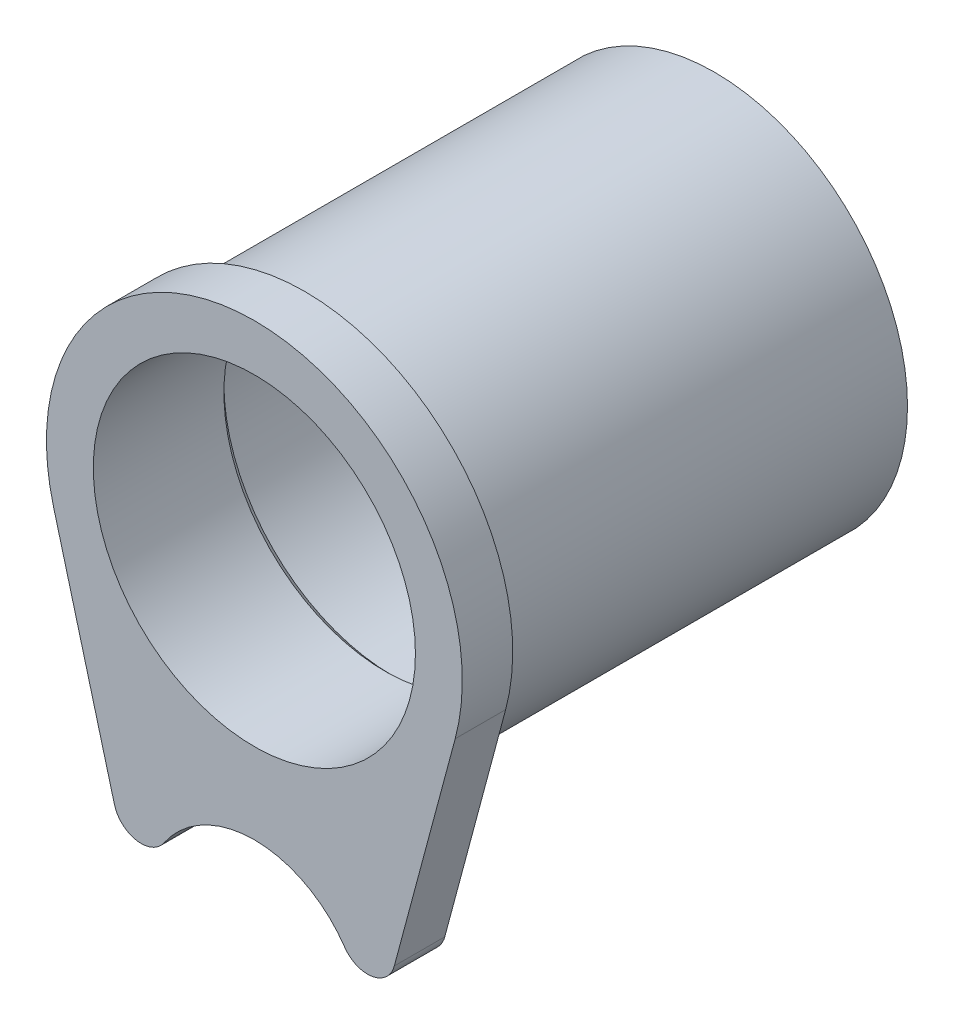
ISO-10303-21;
HEADER;
FILE_DESCRIPTION(('STEP AP214'),'2;1');
FILE_NAME('part.step','',(''),(''),'','','');
FILE_SCHEMA(('AUTOMOTIVE_DESIGN { 1 0 10303 214 1 1 1 1 }'));
ENDSEC;
DATA;
#1=APPLICATION_CONTEXT('core data for automotive mechanical design processes');
#2=APPLICATION_PROTOCOL_DEFINITION('international standard','automotive_design',2000,#1);
#3=PRODUCT_CONTEXT('',#1,'mechanical');
#4=PRODUCT('Part','Part','',(#3));
#5=PRODUCT_RELATED_PRODUCT_CATEGORY('part','',(#4));
#6=PRODUCT_DEFINITION_FORMATION('','',#4);
#7=PRODUCT_DEFINITION_CONTEXT('part definition',#1,'design');
#8=PRODUCT_DEFINITION('design','',#6,#7);
#9=PRODUCT_DEFINITION_SHAPE('','',#8);
#10=(LENGTH_UNIT() NAMED_UNIT(*) SI_UNIT(.MILLI.,.METRE.));
#11=(NAMED_UNIT(*) PLANE_ANGLE_UNIT() SI_UNIT($,.RADIAN.));
#12=(NAMED_UNIT(*) SI_UNIT($,.STERADIAN.) SOLID_ANGLE_UNIT());
#13=UNCERTAINTY_MEASURE_WITH_UNIT(LENGTH_MEASURE(1.E-05),#10,'distance_accuracy_value','');
#14=(GEOMETRIC_REPRESENTATION_CONTEXT(3) GLOBAL_UNCERTAINTY_ASSIGNED_CONTEXT((#13)) GLOBAL_UNIT_ASSIGNED_CONTEXT((#10,
#11,#12)) REPRESENTATION_CONTEXT('',''));
#15=CARTESIAN_POINT('',(0.,0.,0.));
#16=DIRECTION('',(0.,0.,1.));
#17=DIRECTION('',(1.,0.,0.));
#18=AXIS2_PLACEMENT_3D('',#15,#16,#17);
#19=CARTESIAN_POINT('',(0.,0.,-21.082));
#20=DIRECTION('',(0.,0.,1.));
#21=DIRECTION('',(1.,0.,0.));
#22=AXIS2_PLACEMENT_3D('',#19,#20,#21);
#23=CYLINDRICAL_SURFACE('',#22,8.8392);
#24=CARTESIAN_POINT('',(0.,0.,-8.0772));
#25=DIRECTION('',(0.,0.,1.));
#26=DIRECTION('',(-1.,0.,0.));
#27=AXIS2_PLACEMENT_3D('',#24,#25,#26);
#28=CIRCLE('',#27,8.8392);
#29=CARTESIAN_POINT('',(-8.57663798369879,-2.13839601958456,-8.0772));
#30=VERTEX_POINT('',#29);
#31=CARTESIAN_POINT('',(-1.53491097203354,-8.70491269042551,-8.0772));
#32=VERTEX_POINT('',#31);
#33=EDGE_CURVE('E250',#30,#32,#28,.T.);
#34=ORIENTED_EDGE('',*,*,#33,.F.);
#35=DIRECTION('',(0.,0.,1.));
#36=VECTOR('',#35,1.);
#37=CARTESIAN_POINT('',(-8.57663798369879,-2.13839601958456,-8.0772));
#38=LINE('',#37,#36);
#39=CARTESIAN_POINT('',(-8.57663798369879,-2.13839601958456,-5.2324));
#40=VERTEX_POINT('',#39);
#41=EDGE_CURVE('E289',#30,#40,#38,.T.);
#42=ORIENTED_EDGE('',*,*,#41,.T.);
#43=CARTESIAN_POINT('',(0.,0.,-5.2324));
#44=DIRECTION('',(0.,0.,1.));
#45=DIRECTION('',(-1.,0.,0.));
#46=AXIS2_PLACEMENT_3D('',#43,#44,#45);
#47=CIRCLE('',#46,8.8392);
#48=CARTESIAN_POINT('',(-1.53491097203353,-8.70491269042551,-5.2324));
#49=VERTEX_POINT('',#48);
#50=EDGE_CURVE('E265',#40,#49,#47,.T.);
#51=ORIENTED_EDGE('',*,*,#50,.T.);
#52=DIRECTION('',(0.,0.,1.));
#53=VECTOR('',#52,1.);
#54=CARTESIAN_POINT('',(-1.53491097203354,-8.70491269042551,-8.0772));
#55=LINE('',#54,#53);
#56=EDGE_CURVE('E49',#32,#49,#55,.T.);
#57=ORIENTED_EDGE('',*,*,#56,.F.);
#58=EDGE_LOOP('',(#34,#42,#51,#57));
#59=FACE_BOUND('',#58,.T.);
#60=CARTESIAN_POINT('',(0.,0.,-2.6924));
#61=DIRECTION('',(0.,0.,1.));
#62=DIRECTION('',(1.,0.,0.));
#63=AXIS2_PLACEMENT_3D('',#60,#61,#62);
#64=CIRCLE('',#63,8.8392);
#65=CARTESIAN_POINT('',(8.8392,0.,-2.6924));
#66=VERTEX_POINT('',#65);
#67=EDGE_CURVE('E42',#66,#66,#64,.F.);
#68=ORIENTED_EDGE('',*,*,#67,.T.);
#69=EDGE_LOOP('',(#68));
#70=FACE_BOUND('',#69,.T.);
#71=CARTESIAN_POINT('',(0.,0.,-21.082));
#72=DIRECTION('',(0.,0.,1.));
#73=DIRECTION('',(1.,0.,0.));
#74=AXIS2_PLACEMENT_3D('',#71,#72,#73);
#75=CIRCLE('',#74,8.8392);
#76=CARTESIAN_POINT('',(8.8392,0.,-21.082));
#77=VERTEX_POINT('',#76);
#78=EDGE_CURVE('E164',#77,#77,#75,.T.);
#79=ORIENTED_EDGE('',*,*,#78,.T.);
#80=EDGE_LOOP('',(#79));
#81=FACE_BOUND('',#80,.T.);
#82=ADVANCED_FACE('F34',(#59,#70,#81),#23,.T.);
#83=CARTESIAN_POINT('',(0.,0.,-21.082));
#84=DIRECTION('',(0.,0.,1.));
#85=DIRECTION('',(1.,0.,0.));
#86=AXIS2_PLACEMENT_3D('',#83,#84,#85);
#87=PLANE('',#86);
#88=CARTESIAN_POINT('',(0.,0.,-21.082));
#89=DIRECTION('',(0.,0.,-1.));
#90=DIRECTION('',(-1.,0.,0.));
#91=AXIS2_PLACEMENT_3D('',#88,#89,#90);
#92=CIRCLE('',#91,7.747);
#93=CARTESIAN_POINT('',(-7.747,0.,-21.082));
#94=VERTEX_POINT('',#93);
#95=EDGE_CURVE('E161',#94,#94,#92,.T.);
#96=ORIENTED_EDGE('',*,*,#95,.F.);
#97=EDGE_LOOP('',(#96));
#98=FACE_BOUND('',#97,.T.);
#99=ORIENTED_EDGE('',*,*,#78,.F.);
#100=EDGE_LOOP('',(#99));
#101=FACE_BOUND('',#100,.T.);
#102=ADVANCED_FACE('F185',(#98,#101),#87,.F.);
#103=CARTESIAN_POINT('',(0.,0.,0.));
#104=DIRECTION('',(0.,0.,1.));
#105=DIRECTION('',(1.,0.,0.));
#106=AXIS2_PLACEMENT_3D('',#103,#104,#105);
#107=PLANE('',#106);
#108=CARTESIAN_POINT('',(0.,0.,0.));
#109=DIRECTION('',(0.,0.,1.));
#110=DIRECTION('',(1.,0.,0.));
#111=AXIS2_PLACEMENT_3D('',#108,#109,#110);
#112=CIRCLE('',#111,7.3787);
#113=CARTESIAN_POINT('',(7.3787,0.,0.));
#114=VERTEX_POINT('',#113);
#115=EDGE_CURVE('E153',#114,#114,#112,.T.);
#116=ORIENTED_EDGE('',*,*,#115,.F.);
#117=EDGE_LOOP('',(#116));
#118=FACE_BOUND('',#117,.T.);
#119=CARTESIAN_POINT('',(-5.18464880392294,-12.5454980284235,0.));
#120=DIRECTION('',(0.,0.,1.));
#121=DIRECTION('',(1.,0.,0.));
#122=AXIS2_PLACEMENT_3D('',#119,#120,#121);
#123=CIRCLE('',#122,1.27);
#124=CARTESIAN_POINT('',(-6.41137460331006,-12.8741982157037,0.));
#125=VERTEX_POINT('',#124);
#126=CARTESIAN_POINT('',(-4.13512475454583,-13.2606198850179,0.));
#127=VERTEX_POINT('',#126);
#128=EDGE_CURVE('E135',#125,#127,#123,.T.);
#129=ORIENTED_EDGE('',*,*,#128,.T.);
#130=CARTESIAN_POINT('',(0.,-16.0782,0.));
#131=DIRECTION('',(0.,0.,-1.));
#132=DIRECTION('',(1.,0.,0.));
#133=AXIS2_PLACEMENT_3D('',#130,#131,#132);
#134=CIRCLE('',#133,5.0038);
#135=CARTESIAN_POINT('',(4.13512475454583,-13.2606198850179,0.));
#136=VERTEX_POINT('',#135);
#137=EDGE_CURVE('E138',#127,#136,#134,.T.);
#138=ORIENTED_EDGE('',*,*,#137,.T.);
#139=CARTESIAN_POINT('',(5.18464880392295,-12.5454980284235,0.));
#140=DIRECTION('',(0.,0.,1.));
#141=DIRECTION('',(1.,0.,0.));
#142=AXIS2_PLACEMENT_3D('',#139,#140,#141);
#143=CIRCLE('',#142,1.27);
#144=CARTESIAN_POINT('',(6.41137460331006,-12.8741982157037,0.));
#145=VERTEX_POINT('',#144);
#146=EDGE_CURVE('E142',#136,#145,#143,.T.);
#147=ORIENTED_EDGE('',*,*,#146,.T.);
#148=DIRECTION('',(0.258819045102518,0.965925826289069,0.));
#149=VECTOR('',#148,1.);
#150=CARTESIAN_POINT('',(6.41137460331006,-12.8741982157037,0.));
#151=LINE('',#150,#149);
#152=CARTESIAN_POINT('',(9.20044349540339,-2.46525140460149,0.));
#153=VERTEX_POINT('',#152);
#154=EDGE_CURVE('E145',#145,#153,#151,.T.);
#155=ORIENTED_EDGE('',*,*,#154,.T.);
#156=CARTESIAN_POINT('',(0.,0.,0.));
#157=DIRECTION('',(0.,0.,1.));
#158=DIRECTION('',(1.,0.,0.));
#159=AXIS2_PLACEMENT_3D('',#156,#157,#158);
#160=CIRCLE('',#159,9.52500000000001);
#161=CARTESIAN_POINT('',(-9.20044349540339,-2.46525140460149,0.));
#162=VERTEX_POINT('',#161);
#163=EDGE_CURVE('E111',#153,#162,#160,.T.);
#164=ORIENTED_EDGE('',*,*,#163,.T.);
#165=DIRECTION('',(0.258819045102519,-0.965925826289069,0.));
#166=VECTOR('',#165,1.);
#167=CARTESIAN_POINT('',(-9.20044349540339,-2.46525140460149,0.));
#168=LINE('',#167,#166);
#169=EDGE_CURVE('E148',#162,#125,#168,.T.);
#170=ORIENTED_EDGE('',*,*,#169,.T.);
#171=EDGE_LOOP('',(#129,#138,#147,#155,#164,#170));
#172=FACE_BOUND('',#171,.T.);
#173=ADVANCED_FACE('F190',(#118,#172),#107,.T.);
#174=CARTESIAN_POINT('',(0.,0.,-6.35));
#175=DIRECTION('',(0.,0.,-1.));
#176=DIRECTION('',(-1.,0.,0.));
#177=AXIS2_PLACEMENT_3D('',#174,#175,#176);
#178=CYLINDRICAL_SURFACE('',#177,7.747);
#179=CARTESIAN_POINT('',(0.,0.,-6.35));
#180=DIRECTION('',(0.,0.,1.));
#181=DIRECTION('',(1.,0.,0.));
#182=AXIS2_PLACEMENT_3D('',#179,#180,#181);
#183=CIRCLE('',#182,7.747);
#184=CARTESIAN_POINT('',(7.747,0.,-6.35));
#185=VERTEX_POINT('',#184);
#186=EDGE_CURVE('E266',#185,#185,#183,.T.);
#187=ORIENTED_EDGE('',*,*,#186,.T.);
#188=EDGE_LOOP('',(#187));
#189=FACE_BOUND('',#188,.T.);
#190=ORIENTED_EDGE('',*,*,#95,.T.);
#191=EDGE_LOOP('',(#190));
#192=FACE_BOUND('',#191,.T.);
#193=ADVANCED_FACE('F196',(#189,#192),#178,.F.);
#194=CARTESIAN_POINT('',(0.,0.,8.382));
#195=DIRECTION('',(0.,0.,-1.));
#196=DIRECTION('',(-1.,0.,0.));
#197=AXIS2_PLACEMENT_3D('',#194,#195,#196);
#198=CYLINDRICAL_SURFACE('',#197,7.3787);
#199=CARTESIAN_POINT('',(0.,0.,-5.9817));
#200=DIRECTION('',(0.,0.,1.));
#201=DIRECTION('',(1.,0.,0.));
#202=AXIS2_PLACEMENT_3D('',#199,#200,#201);
#203=CIRCLE('',#202,7.3787);
#204=CARTESIAN_POINT('',(7.3787,0.,-5.9817));
#205=VERTEX_POINT('',#204);
#206=EDGE_CURVE('E139',#205,#205,#203,.T.);
#207=ORIENTED_EDGE('',*,*,#206,.F.);
#208=EDGE_LOOP('',(#207));
#209=FACE_BOUND('',#208,.T.);
#210=ORIENTED_EDGE('',*,*,#115,.T.);
#211=EDGE_LOOP('',(#210));
#212=FACE_BOUND('',#211,.T.);
#213=ADVANCED_FACE('F201',(#209,#212),#198,.F.);
#214=CARTESIAN_POINT('',(-5.18464880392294,-12.5454980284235,-2.3114));
#215=DIRECTION('',(0.,0.,1.));
#216=DIRECTION('',(1.,0.,0.));
#217=AXIS2_PLACEMENT_3D('',#214,#215,#216);
#218=CYLINDRICAL_SURFACE('',#217,1.27);
#219=ORIENTED_EDGE('',*,*,#128,.F.);
#220=DIRECTION('',(0.,0.,1.));
#221=VECTOR('',#220,1.);
#222=CARTESIAN_POINT('',(-6.41137460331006,-12.8741982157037,-2.3114));
#223=LINE('',#222,#221);
#224=CARTESIAN_POINT('',(-6.41137460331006,-12.8741982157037,-2.3114));
#225=VERTEX_POINT('',#224);
#226=EDGE_CURVE('E58',#225,#125,#223,.T.);
#227=ORIENTED_EDGE('',*,*,#226,.F.);
#228=CARTESIAN_POINT('',(-5.18464880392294,-12.5454980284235,-2.3114));
#229=DIRECTION('',(0.,0.,1.));
#230=DIRECTION('',(1.,0.,0.));
#231=AXIS2_PLACEMENT_3D('',#228,#229,#230);
#232=CIRCLE('',#231,1.27);
#233=CARTESIAN_POINT('',(-4.13512475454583,-13.2606198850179,-2.3114));
#234=VERTEX_POINT('',#233);
#235=EDGE_CURVE('E151',#225,#234,#232,.T.);
#236=ORIENTED_EDGE('',*,*,#235,.T.);
#237=DIRECTION('',(0.,0.,1.));
#238=VECTOR('',#237,1.);
#239=CARTESIAN_POINT('',(-4.13512475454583,-13.2606198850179,-2.3114));
#240=LINE('',#239,#238);
#241=EDGE_CURVE('E91',#234,#127,#240,.T.);
#242=ORIENTED_EDGE('',*,*,#241,.T.);
#243=EDGE_LOOP('',(#219,#227,#236,#242));
#244=FACE_BOUND('',#243,.T.);
#245=ADVANCED_FACE('F205',(#244),#218,.T.);
#246=CARTESIAN_POINT('',(-9.20044349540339,-2.46525140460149,-2.3114));
#247=DIRECTION('',(-0.965925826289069,-0.258819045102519,0.));
#248=DIRECTION('',(0.258819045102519,-0.965925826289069,0.));
#249=AXIS2_PLACEMENT_3D('',#246,#247,#248);
#250=PLANE('',#249);
#251=ORIENTED_EDGE('',*,*,#169,.F.);
#252=DIRECTION('',(0.,0.,1.));
#253=VECTOR('',#252,1.);
#254=CARTESIAN_POINT('',(-9.20044349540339,-2.46525140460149,-2.3114));
#255=LINE('',#254,#253);
#256=CARTESIAN_POINT('',(-9.20044349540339,-2.46525140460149,-2.3114));
#257=VERTEX_POINT('',#256);
#258=EDGE_CURVE('E116',#257,#162,#255,.T.);
#259=ORIENTED_EDGE('',*,*,#258,.F.);
#260=DIRECTION('',(0.258819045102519,-0.965925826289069,0.));
#261=VECTOR('',#260,1.);
#262=CARTESIAN_POINT('',(-9.20044349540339,-2.46525140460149,-2.3114));
#263=LINE('',#262,#261);
#264=EDGE_CURVE('E125',#257,#225,#263,.T.);
#265=ORIENTED_EDGE('',*,*,#264,.T.);
#266=ORIENTED_EDGE('',*,*,#226,.T.);
#267=EDGE_LOOP('',(#251,#259,#265,#266));
#268=FACE_BOUND('',#267,.T.);
#269=ADVANCED_FACE('F209',(#268),#250,.T.);
#270=CARTESIAN_POINT('',(0.,0.,-2.3114));
#271=DIRECTION('',(0.,0.,1.));
#272=DIRECTION('',(1.,0.,0.));
#273=AXIS2_PLACEMENT_3D('',#270,#271,#272);
#274=CYLINDRICAL_SURFACE('',#273,9.52500000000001);
#275=ORIENTED_EDGE('',*,*,#163,.F.);
#276=DIRECTION('',(0.,0.,1.));
#277=VECTOR('',#276,1.);
#278=CARTESIAN_POINT('',(9.20044349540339,-2.46525140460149,-2.3114));
#279=LINE('',#278,#277);
#280=CARTESIAN_POINT('',(9.20044349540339,-2.46525140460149,-2.3114));
#281=VERTEX_POINT('',#280);
#282=EDGE_CURVE('E105',#281,#153,#279,.T.);
#283=ORIENTED_EDGE('',*,*,#282,.F.);
#284=CARTESIAN_POINT('',(0.,0.,-2.3114));
#285=DIRECTION('',(0.,0.,1.));
#286=DIRECTION('',(1.,0.,0.));
#287=AXIS2_PLACEMENT_3D('',#284,#285,#286);
#288=CIRCLE('',#287,9.52500000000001);
#289=EDGE_CURVE('E108',#281,#257,#288,.T.);
#290=ORIENTED_EDGE('',*,*,#289,.T.);
#291=ORIENTED_EDGE('',*,*,#258,.T.);
#292=EDGE_LOOP('',(#275,#283,#290,#291));
#293=FACE_BOUND('',#292,.T.);
#294=ADVANCED_FACE('F107',(#293),#274,.T.);
#295=CARTESIAN_POINT('',(6.41137460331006,-12.8741982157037,-2.3114));
#296=DIRECTION('',(0.965925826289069,-0.258819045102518,0.));
#297=DIRECTION('',(0.258819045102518,0.965925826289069,0.));
#298=AXIS2_PLACEMENT_3D('',#295,#296,#297);
#299=PLANE('',#298);
#300=ORIENTED_EDGE('',*,*,#154,.F.);
#301=DIRECTION('',(0.,0.,1.));
#302=VECTOR('',#301,1.);
#303=CARTESIAN_POINT('',(6.41137460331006,-12.8741982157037,-2.3114));
#304=LINE('',#303,#302);
#305=CARTESIAN_POINT('',(6.41137460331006,-12.8741982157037,-2.3114));
#306=VERTEX_POINT('',#305);
#307=EDGE_CURVE('E117',#306,#145,#304,.T.);
#308=ORIENTED_EDGE('',*,*,#307,.F.);
#309=DIRECTION('',(0.258819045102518,0.965925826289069,0.));
#310=VECTOR('',#309,1.);
#311=CARTESIAN_POINT('',(6.41137460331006,-12.8741982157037,-2.3114));
#312=LINE('',#311,#310);
#313=EDGE_CURVE('E123',#306,#281,#312,.T.);
#314=ORIENTED_EDGE('',*,*,#313,.T.);
#315=ORIENTED_EDGE('',*,*,#282,.T.);
#316=EDGE_LOOP('',(#300,#308,#314,#315));
#317=FACE_BOUND('',#316,.T.);
#318=ADVANCED_FACE('F127',(#317),#299,.T.);
#319=CARTESIAN_POINT('',(5.18464880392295,-12.5454980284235,-2.3114));
#320=DIRECTION('',(0.,0.,1.));
#321=DIRECTION('',(1.,0.,0.));
#322=AXIS2_PLACEMENT_3D('',#319,#320,#321);
#323=CYLINDRICAL_SURFACE('',#322,1.27);
#324=ORIENTED_EDGE('',*,*,#146,.F.);
#325=DIRECTION('',(0.,0.,1.));
#326=VECTOR('',#325,1.);
#327=CARTESIAN_POINT('',(4.13512475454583,-13.2606198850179,-2.3114));
#328=LINE('',#327,#326);
#329=CARTESIAN_POINT('',(4.13512475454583,-13.2606198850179,-2.3114));
#330=VERTEX_POINT('',#329);
#331=EDGE_CURVE('E156',#330,#136,#328,.T.);
#332=ORIENTED_EDGE('',*,*,#331,.F.);
#333=CARTESIAN_POINT('',(5.18464880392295,-12.5454980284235,-2.3114));
#334=DIRECTION('',(0.,0.,1.));
#335=DIRECTION('',(1.,0.,0.));
#336=AXIS2_PLACEMENT_3D('',#333,#334,#335);
#337=CIRCLE('',#336,1.27);
#338=EDGE_CURVE('E128',#330,#306,#337,.T.);
#339=ORIENTED_EDGE('',*,*,#338,.T.);
#340=ORIENTED_EDGE('',*,*,#307,.T.);
#341=EDGE_LOOP('',(#324,#332,#339,#340));
#342=FACE_BOUND('',#341,.T.);
#343=ADVANCED_FACE('F213',(#342),#323,.T.);
#344=CARTESIAN_POINT('',(0.,-16.0782,-2.3114));
#345=DIRECTION('',(0.,0.,1.));
#346=DIRECTION('',(1.,0.,0.));
#347=AXIS2_PLACEMENT_3D('',#344,#345,#346);
#348=CYLINDRICAL_SURFACE('',#347,5.0038);
#349=ORIENTED_EDGE('',*,*,#137,.F.);
#350=ORIENTED_EDGE('',*,*,#241,.F.);
#351=CARTESIAN_POINT('',(0.,-16.0782,-2.3114));
#352=DIRECTION('',(0.,0.,-1.));
#353=DIRECTION('',(1.,0.,0.));
#354=AXIS2_PLACEMENT_3D('',#351,#352,#353);
#355=CIRCLE('',#354,5.0038);
#356=EDGE_CURVE('E130',#234,#330,#355,.T.);
#357=ORIENTED_EDGE('',*,*,#356,.T.);
#358=ORIENTED_EDGE('',*,*,#331,.T.);
#359=EDGE_LOOP('',(#349,#350,#357,#358));
#360=FACE_BOUND('',#359,.T.);
#361=ADVANCED_FACE('F210',(#360),#348,.F.);
#362=CARTESIAN_POINT('',(-5.18464880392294,-12.5454980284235,-2.3114));
#363=DIRECTION('',(0.,0.,1.));
#364=DIRECTION('',(1.,0.,0.));
#365=AXIS2_PLACEMENT_3D('',#362,#363,#364);
#366=PLANE('',#365);
#367=CARTESIAN_POINT('',(0.,0.,-2.3114));
#368=DIRECTION('',(0.,0.,1.));
#369=DIRECTION('',(1.,0.,0.));
#370=AXIS2_PLACEMENT_3D('',#367,#368,#369);
#371=CIRCLE('',#370,9.2202);
#372=CARTESIAN_POINT('',(9.2202,0.,-2.3114));
#373=VERTEX_POINT('',#372);
#374=EDGE_CURVE('E11',#373,#373,#371,.T.);
#375=ORIENTED_EDGE('',*,*,#374,.T.);
#376=EDGE_LOOP('',(#375));
#377=FACE_BOUND('',#376,.T.);
#378=ORIENTED_EDGE('',*,*,#235,.F.);
#379=ORIENTED_EDGE('',*,*,#264,.F.);
#380=ORIENTED_EDGE('',*,*,#289,.F.);
#381=ORIENTED_EDGE('',*,*,#313,.F.);
#382=ORIENTED_EDGE('',*,*,#338,.F.);
#383=ORIENTED_EDGE('',*,*,#356,.F.);
#384=EDGE_LOOP('',(#378,#379,#380,#381,#382,#383));
#385=FACE_BOUND('',#384,.T.);
#386=ADVANCED_FACE('F121',(#377,#385),#366,.F.);
#387=CARTESIAN_POINT('',(0.,0.,-5.9817));
#388=DIRECTION('',(0.,0.,-1.));
#389=DIRECTION('',(-1.,0.,0.));
#390=AXIS2_PLACEMENT_3D('',#387,#388,#389);
#391=CONICAL_SURFACE('',#390,7.3787,0.785398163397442);
#392=ORIENTED_EDGE('',*,*,#186,.F.);
#393=EDGE_LOOP('',(#392));
#394=FACE_BOUND('',#393,.T.);
#395=ORIENTED_EDGE('',*,*,#206,.T.);
#396=EDGE_LOOP('',(#395));
#397=FACE_BOUND('',#396,.T.);
#398=ADVANCED_FACE('F173',(#394,#397),#391,.F.);
#399=CARTESIAN_POINT('',(0.,0.,-2.6924));
#400=DIRECTION('',(0.,0.,1.));
#401=DIRECTION('',(1.,0.,0.));
#402=AXIS2_PLACEMENT_3D('',#399,#400,#401);
#403=TOROIDAL_SURFACE('',#402,9.2202,0.381);
#404=ORIENTED_EDGE('',*,*,#374,.F.);
#405=EDGE_LOOP('',(#404));
#406=FACE_BOUND('',#405,.T.);
#407=ORIENTED_EDGE('',*,*,#67,.F.);
#408=EDGE_LOOP('',(#407));
#409=FACE_BOUND('',#408,.T.);
#410=ADVANCED_FACE('F36',(#406,#409),#403,.F.);
#411=CARTESIAN_POINT('',(-2.54936362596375,-14.4581595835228,-8.0772));
#412=DIRECTION('',(0.,0.,1.));
#413=DIRECTION('',(1.,0.,0.));
#414=AXIS2_PLACEMENT_3D('',#411,#412,#413);
#415=CYLINDRICAL_SURFACE('',#414,5.842);
#416=CARTESIAN_POINT('',(-2.54936362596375,-14.4581595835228,-5.2324));
#417=DIRECTION('',(0.,0.,1.));
#418=DIRECTION('',(-1.,0.,0.));
#419=AXIS2_PLACEMENT_3D('',#416,#417,#418);
#420=CIRCLE('',#419,5.842);
#421=CARTESIAN_POINT('',(-4.55119357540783,-8.96984100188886,-5.2324));
#422=VERTEX_POINT('',#421);
#423=EDGE_CURVE('E299',#49,#422,#420,.T.);
#424=ORIENTED_EDGE('',*,*,#423,.T.);
#425=DIRECTION('',(0.,0.,1.));
#426=VECTOR('',#425,1.);
#427=CARTESIAN_POINT('',(-4.55119357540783,-8.96984100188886,-8.0772));
#428=LINE('',#427,#426);
#429=CARTESIAN_POINT('',(-4.55119357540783,-8.96984100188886,-8.0772));
#430=VERTEX_POINT('',#429);
#431=EDGE_CURVE('E267',#430,#422,#428,.T.);
#432=ORIENTED_EDGE('',*,*,#431,.F.);
#433=CARTESIAN_POINT('',(-2.54936362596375,-14.4581595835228,-8.0772));
#434=DIRECTION('',(0.,0.,1.));
#435=DIRECTION('',(-1.,0.,0.));
#436=AXIS2_PLACEMENT_3D('',#433,#434,#435);
#437=CIRCLE('',#436,5.842);
#438=EDGE_CURVE('E253',#32,#430,#437,.T.);
#439=ORIENTED_EDGE('',*,*,#438,.F.);
#440=ORIENTED_EDGE('',*,*,#56,.T.);
#441=EDGE_LOOP('',(#424,#432,#439,#440));
#442=FACE_BOUND('',#441,.T.);
#443=ADVANCED_FACE('F172',(#442),#415,.F.);
#444=CARTESIAN_POINT('',(0.,0.,-8.0772));
#445=DIRECTION('',(0.,0.,1.));
#446=DIRECTION('',(1.,0.,0.));
#447=AXIS2_PLACEMENT_3D('',#444,#445,#446);
#448=CYLINDRICAL_SURFACE('',#447,10.0584);
#449=CARTESIAN_POINT('',(0.,0.,-5.2324));
#450=DIRECTION('',(0.,0.,-1.));
#451=DIRECTION('',(-1.,0.,0.));
#452=AXIS2_PLACEMENT_3D('',#449,#450,#451);
#453=CIRCLE('',#452,10.0584);
#454=CARTESIAN_POINT('',(-8.36394188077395,-5.58711793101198,-5.2324));
#455=VERTEX_POINT('',#454);
#456=EDGE_CURVE('E296',#422,#455,#453,.T.);
#457=ORIENTED_EDGE('',*,*,#456,.T.);
#458=DIRECTION('',(0.,0.,1.));
#459=VECTOR('',#458,1.);
#460=CARTESIAN_POINT('',(-8.36394188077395,-5.58711793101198,-8.0772));
#461=LINE('',#460,#459);
#462=CARTESIAN_POINT('',(-8.36394188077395,-5.58711793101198,-8.0772));
#463=VERTEX_POINT('',#462);
#464=EDGE_CURVE('E272',#463,#455,#461,.T.);
#465=ORIENTED_EDGE('',*,*,#464,.F.);
#466=CARTESIAN_POINT('',(0.,0.,-8.0772));
#467=DIRECTION('',(0.,0.,-1.));
#468=DIRECTION('',(-1.,0.,0.));
#469=AXIS2_PLACEMENT_3D('',#466,#467,#468);
#470=CIRCLE('',#469,10.0584);
#471=EDGE_CURVE('E305',#430,#463,#470,.T.);
#472=ORIENTED_EDGE('',*,*,#471,.F.);
#473=ORIENTED_EDGE('',*,*,#431,.T.);
#474=EDGE_LOOP('',(#457,#465,#472,#473));
#475=FACE_BOUND('',#474,.T.);
#476=ADVANCED_FACE('F179',(#475),#448,.T.);
#477=CARTESIAN_POINT('',(-8.55485955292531,-4.87460347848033,-8.0772));
#478=DIRECTION('',(0.965925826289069,0.258819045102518,0.));
#479=DIRECTION('',(-0.258819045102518,0.965925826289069,0.));
#480=AXIS2_PLACEMENT_3D('',#477,#478,#479);
#481=PLANE('',#480);
#482=DIRECTION('',(-0.258819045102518,0.965925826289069,0.));
#483=VECTOR('',#482,1.);
#484=CARTESIAN_POINT('',(-8.55485955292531,-4.87460347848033,-5.2324));
#485=LINE('',#484,#483);
#486=CARTESIAN_POINT('',(-8.55485955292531,-4.87460347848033,-5.2324));
#487=VERTEX_POINT('',#486);
#488=EDGE_CURVE('E293',#455,#487,#485,.T.);
#489=ORIENTED_EDGE('',*,*,#488,.T.);
#490=DIRECTION('',(0.,0.,1.));
#491=VECTOR('',#490,1.);
#492=CARTESIAN_POINT('',(-8.55485955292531,-4.87460347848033,-8.0772));
#493=LINE('',#492,#491);
#494=CARTESIAN_POINT('',(-8.55485955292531,-4.87460347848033,-8.0772));
#495=VERTEX_POINT('',#494);
#496=EDGE_CURVE('E286',#495,#487,#493,.T.);
#497=ORIENTED_EDGE('',*,*,#496,.F.);
#498=DIRECTION('',(-0.258819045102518,0.965925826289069,0.));
#499=VECTOR('',#498,1.);
#500=CARTESIAN_POINT('',(-8.55485955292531,-4.87460347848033,-8.0772));
#501=LINE('',#500,#499);
#502=EDGE_CURVE('E303',#463,#495,#501,.T.);
#503=ORIENTED_EDGE('',*,*,#502,.F.);
#504=ORIENTED_EDGE('',*,*,#464,.T.);
#505=EDGE_LOOP('',(#489,#497,#503,#504));
#506=FACE_BOUND('',#505,.T.);
#507=ADVANCED_FACE('F228',(#506),#481,.F.);
#508=CARTESIAN_POINT('',(-14.2451056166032,-3.5517037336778,-8.0772));
#509=DIRECTION('',(0.,0.,1.));
#510=DIRECTION('',(1.,0.,0.));
#511=AXIS2_PLACEMENT_3D('',#508,#509,#510);
#512=CYLINDRICAL_SURFACE('',#511,5.842);
#513=CARTESIAN_POINT('',(-14.2451056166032,-3.5517037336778,-5.2324));
#514=DIRECTION('',(0.,0.,1.));
#515=DIRECTION('',(-1.,0.,0.));
#516=AXIS2_PLACEMENT_3D('',#513,#514,#515);
#517=CIRCLE('',#516,5.842);
#518=EDGE_CURVE('E261',#487,#40,#517,.T.);
#519=ORIENTED_EDGE('',*,*,#518,.T.);
#520=ORIENTED_EDGE('',*,*,#41,.F.);
#521=CARTESIAN_POINT('',(-14.2451056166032,-3.5517037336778,-8.0772));
#522=DIRECTION('',(0.,0.,1.));
#523=DIRECTION('',(-1.,0.,0.));
#524=AXIS2_PLACEMENT_3D('',#521,#522,#523);
#525=CIRCLE('',#524,5.842);
#526=EDGE_CURVE('E257',#495,#30,#525,.T.);
#527=ORIENTED_EDGE('',*,*,#526,.F.);
#528=ORIENTED_EDGE('',*,*,#496,.T.);
#529=EDGE_LOOP('',(#519,#520,#527,#528));
#530=FACE_BOUND('',#529,.T.);
#531=ADVANCED_FACE('F232',(#530),#512,.F.);
#532=CARTESIAN_POINT('',(0.,0.,-8.0772));
#533=DIRECTION('',(0.,0.,-1.));
#534=DIRECTION('',(-1.,0.,0.));
#535=AXIS2_PLACEMENT_3D('',#532,#533,#534);
#536=PLANE('',#535);
#537=ORIENTED_EDGE('',*,*,#33,.T.);
#538=ORIENTED_EDGE('',*,*,#438,.T.);
#539=ORIENTED_EDGE('',*,*,#471,.T.);
#540=ORIENTED_EDGE('',*,*,#502,.T.);
#541=ORIENTED_EDGE('',*,*,#526,.T.);
#542=EDGE_LOOP('',(#537,#538,#539,#540,#541));
#543=FACE_BOUND('',#542,.T.);
#544=ADVANCED_FACE('F236',(#543),#536,.T.);
#545=CARTESIAN_POINT('',(0.,0.,-5.2324));
#546=DIRECTION('',(0.,0.,-1.));
#547=DIRECTION('',(-1.,0.,0.));
#548=AXIS2_PLACEMENT_3D('',#545,#546,#547);
#549=PLANE('',#548);
#550=ORIENTED_EDGE('',*,*,#50,.F.);
#551=ORIENTED_EDGE('',*,*,#518,.F.);
#552=ORIENTED_EDGE('',*,*,#488,.F.);
#553=ORIENTED_EDGE('',*,*,#456,.F.);
#554=ORIENTED_EDGE('',*,*,#423,.F.);
#555=EDGE_LOOP('',(#550,#551,#552,#553,#554));
#556=FACE_BOUND('',#555,.T.);
#557=ADVANCED_FACE('F238',(#556),#549,.F.);
#558=CLOSED_SHELL('',(#82,#102,#173,#193,#213,#245,#269,#294,#318,#343,#361,#386,#398,#410,#443,
#476,#507,#531,#544,#557));
#559=MANIFOLD_SOLID_BREP('B2',#558);
#560=ADVANCED_BREP_SHAPE_REPRESENTATION('',(#18,#559),#14);
#561=SHAPE_DEFINITION_REPRESENTATION(#9,#560);
ENDSEC;
END-ISO-10303-21;
